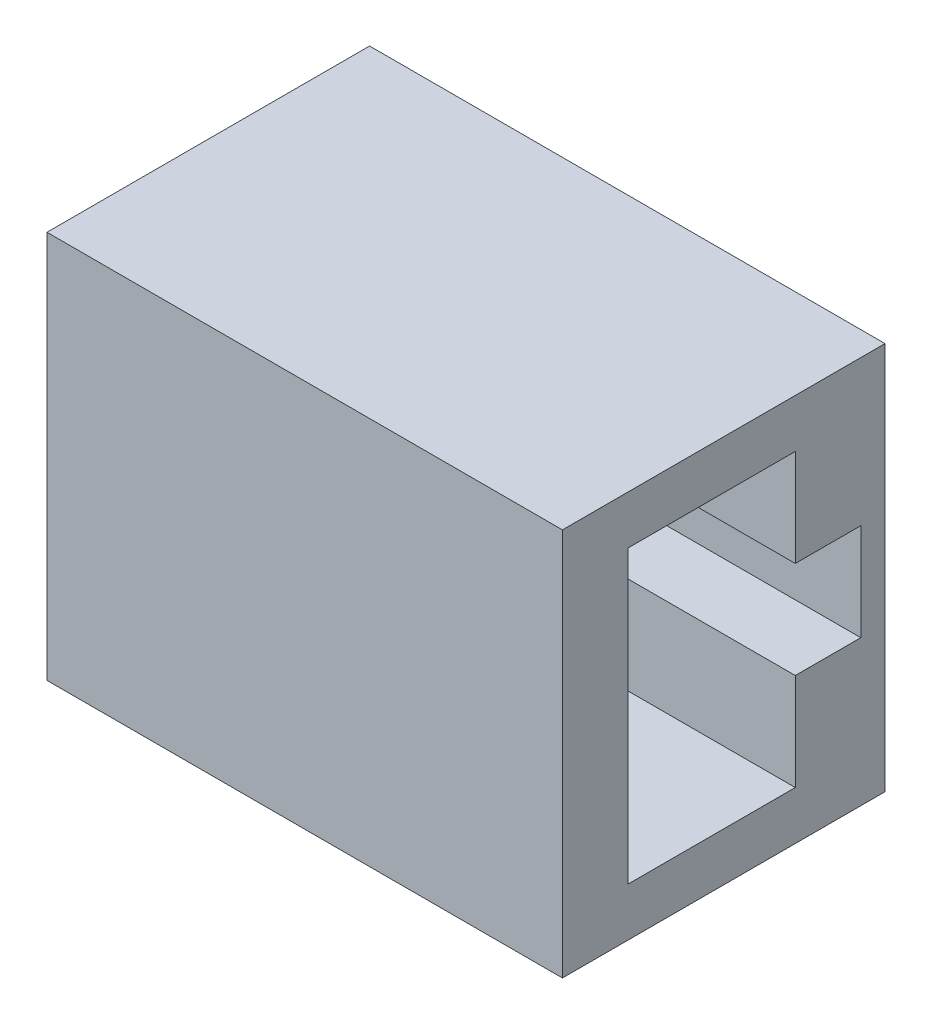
ISO-10303-21;
HEADER;
FILE_DESCRIPTION(('STEP AP214'),'2;1');
FILE_NAME('part.step','',(''),(''),'','','');
FILE_SCHEMA(('AUTOMOTIVE_DESIGN { 1 0 10303 214 1 1 1 1 }'));
ENDSEC;
DATA;
#1=APPLICATION_CONTEXT('core data for automotive mechanical design processes');
#2=APPLICATION_PROTOCOL_DEFINITION('international standard','automotive_design',2000,#1);
#3=PRODUCT_CONTEXT('',#1,'mechanical');
#4=PRODUCT('Part','Part','',(#3));
#5=PRODUCT_RELATED_PRODUCT_CATEGORY('part','',(#4));
#6=PRODUCT_DEFINITION_FORMATION('','',#4);
#7=PRODUCT_DEFINITION_CONTEXT('part definition',#1,'design');
#8=PRODUCT_DEFINITION('design','',#6,#7);
#9=PRODUCT_DEFINITION_SHAPE('','',#8);
#10=(LENGTH_UNIT() NAMED_UNIT(*) SI_UNIT(.MILLI.,.METRE.));
#11=(NAMED_UNIT(*) PLANE_ANGLE_UNIT() SI_UNIT($,.RADIAN.));
#12=(NAMED_UNIT(*) SI_UNIT($,.STERADIAN.) SOLID_ANGLE_UNIT());
#13=UNCERTAINTY_MEASURE_WITH_UNIT(LENGTH_MEASURE(1.E-05),#10,'distance_accuracy_value','');
#14=(GEOMETRIC_REPRESENTATION_CONTEXT(3) GLOBAL_UNCERTAINTY_ASSIGNED_CONTEXT((#13)) GLOBAL_UNIT_ASSIGNED_CONTEXT((#10,
#11,#12)) REPRESENTATION_CONTEXT('',''));
#15=CARTESIAN_POINT('',(0.,0.,0.));
#16=DIRECTION('',(0.,0.,1.));
#17=DIRECTION('',(1.,0.,0.));
#18=AXIS2_PLACEMENT_3D('',#15,#16,#17);
#19=CARTESIAN_POINT('',(10.625,8.,13.3));
#20=DIRECTION('',(-1.,0.,0.));
#21=DIRECTION('',(0.,0.,1.));
#22=AXIS2_PLACEMENT_3D('',#19,#20,#21);
#23=PLANE('',#22);
#24=DIRECTION('',(0.,0.,-1.));
#25=VECTOR('',#24,1.);
#26=CARTESIAN_POINT('',(10.625,6.,10.6));
#27=LINE('',#26,#25);
#28=CARTESIAN_POINT('',(10.625,6.,10.6));
#29=VERTEX_POINT('',#28);
#30=CARTESIAN_POINT('',(10.625,6.,3.7));
#31=VERTEX_POINT('',#30);
#32=EDGE_CURVE('E145',#29,#31,#27,.T.);
#33=ORIENTED_EDGE('',*,*,#32,.T.);
#34=DIRECTION('',(0.,-1.,0.));
#35=VECTOR('',#34,1.);
#36=CARTESIAN_POINT('',(10.625,6.,3.7));
#37=LINE('',#36,#35);
#38=CARTESIAN_POINT('',(10.625,2.,3.7));
#39=VERTEX_POINT('',#38);
#40=EDGE_CURVE('E204',#31,#39,#37,.T.);
#41=ORIENTED_EDGE('',*,*,#40,.T.);
#42=DIRECTION('',(0.,0.,-1.));
#43=VECTOR('',#42,1.);
#44=CARTESIAN_POINT('',(10.625,2.,3.7));
#45=LINE('',#44,#43);
#46=CARTESIAN_POINT('',(10.625,2.,1.));
#47=VERTEX_POINT('',#46);
#48=EDGE_CURVE('E205',#39,#47,#45,.T.);
#49=ORIENTED_EDGE('',*,*,#48,.T.);
#50=DIRECTION('',(0.,1.,0.));
#51=VECTOR('',#50,1.);
#52=CARTESIAN_POINT('',(10.625,-2.,1.));
#53=LINE('',#52,#51);
#54=CARTESIAN_POINT('',(10.625,-2.,1.));
#55=VERTEX_POINT('',#54);
#56=EDGE_CURVE('E237',#55,#47,#53,.T.);
#57=ORIENTED_EDGE('',*,*,#56,.F.);
#58=DIRECTION('',(0.,0.,-1.));
#59=VECTOR('',#58,1.);
#60=CARTESIAN_POINT('',(10.625,-2.,3.7));
#61=LINE('',#60,#59);
#62=CARTESIAN_POINT('',(10.625,-2.,3.7));
#63=VERTEX_POINT('',#62);
#64=EDGE_CURVE('E210',#63,#55,#61,.T.);
#65=ORIENTED_EDGE('',*,*,#64,.F.);
#66=DIRECTION('',(0.,-1.,0.));
#67=VECTOR('',#66,1.);
#68=CARTESIAN_POINT('',(10.625,-2.,3.7));
#69=LINE('',#68,#67);
#70=CARTESIAN_POINT('',(10.625,-6.,3.7));
#71=VERTEX_POINT('',#70);
#72=EDGE_CURVE('E176',#63,#71,#69,.T.);
#73=ORIENTED_EDGE('',*,*,#72,.T.);
#74=DIRECTION('',(0.,0.,-1.));
#75=VECTOR('',#74,1.);
#76=CARTESIAN_POINT('',(10.625,-6.,10.6));
#77=LINE('',#76,#75);
#78=CARTESIAN_POINT('',(10.625,-6.,10.6));
#79=VERTEX_POINT('',#78);
#80=EDGE_CURVE('E150',#79,#71,#77,.T.);
#81=ORIENTED_EDGE('',*,*,#80,.F.);
#82=DIRECTION('',(0.,-1.,0.));
#83=VECTOR('',#82,1.);
#84=CARTESIAN_POINT('',(10.625,6.,10.6));
#85=LINE('',#84,#83);
#86=EDGE_CURVE('E181',#29,#79,#85,.T.);
#87=ORIENTED_EDGE('',*,*,#86,.F.);
#88=EDGE_LOOP('',(#33,#41,#49,#57,#65,#73,#81,#87));
#89=FACE_BOUND('',#88,.T.);
#90=DIRECTION('',(0.,1.,0.));
#91=VECTOR('',#90,1.);
#92=CARTESIAN_POINT('',(10.625,8.,0.));
#93=LINE('',#92,#91);
#94=CARTESIAN_POINT('',(10.625,-8.,0.));
#95=VERTEX_POINT('',#94);
#96=CARTESIAN_POINT('',(10.625,8.,0.));
#97=VERTEX_POINT('',#96);
#98=EDGE_CURVE('E192',#95,#97,#93,.T.);
#99=ORIENTED_EDGE('',*,*,#98,.T.);
#100=DIRECTION('',(0.,0.,-1.));
#101=VECTOR('',#100,1.);
#102=CARTESIAN_POINT('',(10.625,8.,13.3));
#103=LINE('',#102,#101);
#104=CARTESIAN_POINT('',(10.625,8.,13.3));
#105=VERTEX_POINT('',#104);
#106=EDGE_CURVE('E39',#105,#97,#103,.T.);
#107=ORIENTED_EDGE('',*,*,#106,.F.);
#108=DIRECTION('',(0.,1.,0.));
#109=VECTOR('',#108,1.);
#110=CARTESIAN_POINT('',(10.625,8.,13.3));
#111=LINE('',#110,#109);
#112=CARTESIAN_POINT('',(10.625,-8.,13.3));
#113=VERTEX_POINT('',#112);
#114=EDGE_CURVE('E265',#113,#105,#111,.T.);
#115=ORIENTED_EDGE('',*,*,#114,.F.);
#116=DIRECTION('',(0.,0.,-1.));
#117=VECTOR('',#116,1.);
#118=CARTESIAN_POINT('',(10.625,-8.,13.3));
#119=LINE('',#118,#117);
#120=EDGE_CURVE('E26',#113,#95,#119,.T.);
#121=ORIENTED_EDGE('',*,*,#120,.T.);
#122=EDGE_LOOP('',(#99,#107,#115,#121));
#123=FACE_BOUND('',#122,.T.);
#124=ADVANCED_FACE('F17',(#89,#123),#23,.F.);
#125=CARTESIAN_POINT('',(-10.625,8.,13.3));
#126=DIRECTION('',(1.,0.,0.));
#127=DIRECTION('',(0.,1.,0.));
#128=AXIS2_PLACEMENT_3D('',#125,#126,#127);
#129=PLANE('',#128);
#130=DIRECTION('',(0.,-1.,0.));
#131=VECTOR('',#130,1.);
#132=CARTESIAN_POINT('',(-10.625,8.,0.));
#133=LINE('',#132,#131);
#134=CARTESIAN_POINT('',(-10.625,8.,0.));
#135=VERTEX_POINT('',#134);
#136=CARTESIAN_POINT('',(-10.625,-8.,0.));
#137=VERTEX_POINT('',#136);
#138=EDGE_CURVE('E254',#135,#137,#133,.T.);
#139=ORIENTED_EDGE('',*,*,#138,.T.);
#140=DIRECTION('',(0.,0.,-1.));
#141=VECTOR('',#140,1.);
#142=CARTESIAN_POINT('',(-10.625,-8.,13.3));
#143=LINE('',#142,#141);
#144=CARTESIAN_POINT('',(-10.625,-8.,13.3));
#145=VERTEX_POINT('',#144);
#146=EDGE_CURVE('E11',#145,#137,#143,.T.);
#147=ORIENTED_EDGE('',*,*,#146,.F.);
#148=DIRECTION('',(0.,-1.,0.));
#149=VECTOR('',#148,1.);
#150=CARTESIAN_POINT('',(-10.625,8.,13.3));
#151=LINE('',#150,#149);
#152=CARTESIAN_POINT('',(-10.625,8.,13.3));
#153=VERTEX_POINT('',#152);
#154=EDGE_CURVE('E191',#153,#145,#151,.T.);
#155=ORIENTED_EDGE('',*,*,#154,.F.);
#156=DIRECTION('',(0.,0.,-1.));
#157=VECTOR('',#156,1.);
#158=CARTESIAN_POINT('',(-10.625,8.,13.3));
#159=LINE('',#158,#157);
#160=EDGE_CURVE('E228',#153,#135,#159,.T.);
#161=ORIENTED_EDGE('',*,*,#160,.T.);
#162=EDGE_LOOP('',(#139,#147,#155,#161));
#163=FACE_BOUND('',#162,.T.);
#164=ADVANCED_FACE('F19',(#163),#129,.F.);
#165=CARTESIAN_POINT('',(-10.625,-8.,13.3));
#166=DIRECTION('',(0.,1.,0.));
#167=DIRECTION('',(1.,0.,0.));
#168=AXIS2_PLACEMENT_3D('',#165,#166,#167);
#169=PLANE('',#168);
#170=DIRECTION('',(1.,0.,0.));
#171=VECTOR('',#170,1.);
#172=CARTESIAN_POINT('',(-10.625,-8.,0.));
#173=LINE('',#172,#171);
#174=EDGE_CURVE('E188',#137,#95,#173,.T.);
#175=ORIENTED_EDGE('',*,*,#174,.T.);
#176=ORIENTED_EDGE('',*,*,#120,.F.);
#177=DIRECTION('',(1.,0.,0.));
#178=VECTOR('',#177,1.);
#179=CARTESIAN_POINT('',(-10.625,-8.,13.3));
#180=LINE('',#179,#178);
#181=EDGE_CURVE('E269',#145,#113,#180,.T.);
#182=ORIENTED_EDGE('',*,*,#181,.F.);
#183=ORIENTED_EDGE('',*,*,#146,.T.);
#184=EDGE_LOOP('',(#175,#176,#182,#183));
#185=FACE_BOUND('',#184,.T.);
#186=ADVANCED_FACE('F283',(#185),#169,.F.);
#187=CARTESIAN_POINT('',(-10.625,8.,13.3));
#188=DIRECTION('',(0.,-1.,0.));
#189=DIRECTION('',(0.,0.,-1.));
#190=AXIS2_PLACEMENT_3D('',#187,#188,#189);
#191=PLANE('',#190);
#192=DIRECTION('',(-1.,0.,0.));
#193=VECTOR('',#192,1.);
#194=CARTESIAN_POINT('',(-10.625,8.,0.));
#195=LINE('',#194,#193);
#196=EDGE_CURVE('E218',#97,#135,#195,.T.);
#197=ORIENTED_EDGE('',*,*,#196,.T.);
#198=ORIENTED_EDGE('',*,*,#160,.F.);
#199=DIRECTION('',(-1.,0.,0.));
#200=VECTOR('',#199,1.);
#201=CARTESIAN_POINT('',(-10.625,8.,13.3));
#202=LINE('',#201,#200);
#203=EDGE_CURVE('E261',#105,#153,#202,.T.);
#204=ORIENTED_EDGE('',*,*,#203,.F.);
#205=ORIENTED_EDGE('',*,*,#106,.T.);
#206=EDGE_LOOP('',(#197,#198,#204,#205));
#207=FACE_BOUND('',#206,.T.);
#208=ADVANCED_FACE('F288',(#207),#191,.F.);
#209=CARTESIAN_POINT('',(0.,0.,13.3));
#210=DIRECTION('',(0.,0.,1.));
#211=DIRECTION('',(1.,0.,0.));
#212=AXIS2_PLACEMENT_3D('',#209,#210,#211);
#213=PLANE('',#212);
#214=ORIENTED_EDGE('',*,*,#154,.T.);
#215=ORIENTED_EDGE('',*,*,#181,.T.);
#216=ORIENTED_EDGE('',*,*,#114,.T.);
#217=ORIENTED_EDGE('',*,*,#203,.T.);
#218=EDGE_LOOP('',(#214,#215,#216,#217));
#219=FACE_BOUND('',#218,.T.);
#220=ADVANCED_FACE('F291',(#219),#213,.T.);
#221=CARTESIAN_POINT('',(0.,0.,0.));
#222=DIRECTION('',(0.,0.,1.));
#223=DIRECTION('',(1.,0.,0.));
#224=AXIS2_PLACEMENT_3D('',#221,#222,#223);
#225=PLANE('',#224);
#226=ORIENTED_EDGE('',*,*,#138,.F.);
#227=ORIENTED_EDGE('',*,*,#196,.F.);
#228=ORIENTED_EDGE('',*,*,#98,.F.);
#229=ORIENTED_EDGE('',*,*,#174,.F.);
#230=EDGE_LOOP('',(#226,#227,#228,#229));
#231=FACE_BOUND('',#230,.T.);
#232=ADVANCED_FACE('F286',(#231),#225,.F.);
#233=CARTESIAN_POINT('',(0.825,6.,10.6));
#234=DIRECTION('',(0.,-1.,0.));
#235=DIRECTION('',(-1.,0.,0.));
#236=AXIS2_PLACEMENT_3D('',#233,#234,#235);
#237=PLANE('',#236);
#238=ORIENTED_EDGE('',*,*,#32,.F.);
#239=DIRECTION('',(1.,0.,0.));
#240=VECTOR('',#239,1.);
#241=CARTESIAN_POINT('',(0.825,6.,10.6));
#242=LINE('',#241,#240);
#243=CARTESIAN_POINT('',(0.825,6.,10.6));
#244=VERTEX_POINT('',#243);
#245=EDGE_CURVE('E139',#244,#29,#242,.T.);
#246=ORIENTED_EDGE('',*,*,#245,.F.);
#247=DIRECTION('',(0.,0.,-1.));
#248=VECTOR('',#247,1.);
#249=CARTESIAN_POINT('',(0.825,6.,10.6));
#250=LINE('',#249,#248);
#251=CARTESIAN_POINT('',(0.825,6.,3.7));
#252=VERTEX_POINT('',#251);
#253=EDGE_CURVE('E144',#244,#252,#250,.T.);
#254=ORIENTED_EDGE('',*,*,#253,.T.);
#255=DIRECTION('',(1.,0.,0.));
#256=VECTOR('',#255,1.);
#257=CARTESIAN_POINT('',(0.825,6.,3.7));
#258=LINE('',#257,#256);
#259=EDGE_CURVE('E249',#252,#31,#258,.T.);
#260=ORIENTED_EDGE('',*,*,#259,.T.);
#261=EDGE_LOOP('',(#238,#246,#254,#260));
#262=FACE_BOUND('',#261,.T.);
#263=ADVANCED_FACE('F141',(#262),#237,.T.);
#264=CARTESIAN_POINT('',(0.825,6.,3.7));
#265=DIRECTION('',(0.,0.,1.));
#266=DIRECTION('',(0.,-1.,0.));
#267=AXIS2_PLACEMENT_3D('',#264,#265,#266);
#268=PLANE('',#267);
#269=ORIENTED_EDGE('',*,*,#40,.F.);
#270=ORIENTED_EDGE('',*,*,#259,.F.);
#271=DIRECTION('',(0.,-1.,0.));
#272=VECTOR('',#271,1.);
#273=CARTESIAN_POINT('',(0.825,6.,3.7));
#274=LINE('',#273,#272);
#275=CARTESIAN_POINT('',(0.825,2.,3.7));
#276=VERTEX_POINT('',#275);
#277=EDGE_CURVE('E167',#252,#276,#274,.T.);
#278=ORIENTED_EDGE('',*,*,#277,.T.);
#279=DIRECTION('',(1.,0.,0.));
#280=VECTOR('',#279,1.);
#281=CARTESIAN_POINT('',(0.825,2.,3.7));
#282=LINE('',#281,#280);
#283=EDGE_CURVE('E200',#276,#39,#282,.T.);
#284=ORIENTED_EDGE('',*,*,#283,.T.);
#285=EDGE_LOOP('',(#269,#270,#278,#284));
#286=FACE_BOUND('',#285,.T.);
#287=ADVANCED_FACE('F307',(#286),#268,.T.);
#288=CARTESIAN_POINT('',(0.825,2.,3.7));
#289=DIRECTION('',(0.,-1.,0.));
#290=DIRECTION('',(-1.,0.,0.));
#291=AXIS2_PLACEMENT_3D('',#288,#289,#290);
#292=PLANE('',#291);
#293=ORIENTED_EDGE('',*,*,#48,.F.);
#294=ORIENTED_EDGE('',*,*,#283,.F.);
#295=DIRECTION('',(0.,0.,-1.));
#296=VECTOR('',#295,1.);
#297=CARTESIAN_POINT('',(0.825,2.,3.7));
#298=LINE('',#297,#296);
#299=CARTESIAN_POINT('',(0.825,2.,1.));
#300=VERTEX_POINT('',#299);
#301=EDGE_CURVE('E209',#276,#300,#298,.T.);
#302=ORIENTED_EDGE('',*,*,#301,.T.);
#303=DIRECTION('',(1.,0.,0.));
#304=VECTOR('',#303,1.);
#305=CARTESIAN_POINT('',(0.825,2.,1.));
#306=LINE('',#305,#304);
#307=EDGE_CURVE('E241',#300,#47,#306,.T.);
#308=ORIENTED_EDGE('',*,*,#307,.T.);
#309=EDGE_LOOP('',(#293,#294,#302,#308));
#310=FACE_BOUND('',#309,.T.);
#311=ADVANCED_FACE('F310',(#310),#292,.T.);
#312=CARTESIAN_POINT('',(0.825,-2.,1.));
#313=DIRECTION('',(0.,0.,-1.));
#314=DIRECTION('',(0.,-1.,0.));
#315=AXIS2_PLACEMENT_3D('',#312,#313,#314);
#316=PLANE('',#315);
#317=ORIENTED_EDGE('',*,*,#56,.T.);
#318=ORIENTED_EDGE('',*,*,#307,.F.);
#319=DIRECTION('',(0.,1.,0.));
#320=VECTOR('',#319,1.);
#321=CARTESIAN_POINT('',(0.825,-2.,1.));
#322=LINE('',#321,#320);
#323=CARTESIAN_POINT('',(0.825,-2.,1.));
#324=VERTEX_POINT('',#323);
#325=EDGE_CURVE('E196',#324,#300,#322,.T.);
#326=ORIENTED_EDGE('',*,*,#325,.F.);
#327=DIRECTION('',(1.,0.,0.));
#328=VECTOR('',#327,1.);
#329=CARTESIAN_POINT('',(0.825,-2.,1.));
#330=LINE('',#329,#328);
#331=EDGE_CURVE('E214',#324,#55,#330,.T.);
#332=ORIENTED_EDGE('',*,*,#331,.T.);
#333=EDGE_LOOP('',(#317,#318,#326,#332));
#334=FACE_BOUND('',#333,.T.);
#335=ADVANCED_FACE('F312',(#334),#316,.F.);
#336=CARTESIAN_POINT('',(0.825,-2.,3.7));
#337=DIRECTION('',(0.,-1.,0.));
#338=DIRECTION('',(-1.,0.,0.));
#339=AXIS2_PLACEMENT_3D('',#336,#337,#338);
#340=PLANE('',#339);
#341=ORIENTED_EDGE('',*,*,#64,.T.);
#342=ORIENTED_EDGE('',*,*,#331,.F.);
#343=DIRECTION('',(0.,0.,-1.));
#344=VECTOR('',#343,1.);
#345=CARTESIAN_POINT('',(0.825,-2.,3.7));
#346=LINE('',#345,#344);
#347=CARTESIAN_POINT('',(0.825,-2.,3.7));
#348=VERTEX_POINT('',#347);
#349=EDGE_CURVE('E187',#348,#324,#346,.T.);
#350=ORIENTED_EDGE('',*,*,#349,.F.);
#351=DIRECTION('',(1.,0.,0.));
#352=VECTOR('',#351,1.);
#353=CARTESIAN_POINT('',(0.825,-2.,3.7));
#354=LINE('',#353,#352);
#355=EDGE_CURVE('E215',#348,#63,#354,.T.);
#356=ORIENTED_EDGE('',*,*,#355,.T.);
#357=EDGE_LOOP('',(#341,#342,#350,#356));
#358=FACE_BOUND('',#357,.T.);
#359=ADVANCED_FACE('F315',(#358),#340,.F.);
#360=CARTESIAN_POINT('',(0.825,-2.,3.7));
#361=DIRECTION('',(0.,0.,1.));
#362=DIRECTION('',(0.,-1.,0.));
#363=AXIS2_PLACEMENT_3D('',#360,#361,#362);
#364=PLANE('',#363);
#365=ORIENTED_EDGE('',*,*,#72,.F.);
#366=ORIENTED_EDGE('',*,*,#355,.F.);
#367=DIRECTION('',(0.,-1.,0.));
#368=VECTOR('',#367,1.);
#369=CARTESIAN_POINT('',(0.825,-2.,3.7));
#370=LINE('',#369,#368);
#371=CARTESIAN_POINT('',(0.825,-6.,3.7));
#372=VERTEX_POINT('',#371);
#373=EDGE_CURVE('E180',#348,#372,#370,.T.);
#374=ORIENTED_EDGE('',*,*,#373,.T.);
#375=DIRECTION('',(1.,0.,0.));
#376=VECTOR('',#375,1.);
#377=CARTESIAN_POINT('',(0.825,-6.,3.7));
#378=LINE('',#377,#376);
#379=EDGE_CURVE('E174',#372,#71,#378,.T.);
#380=ORIENTED_EDGE('',*,*,#379,.T.);
#381=EDGE_LOOP('',(#365,#366,#374,#380));
#382=FACE_BOUND('',#381,.T.);
#383=ADVANCED_FACE('F317',(#382),#364,.T.);
#384=CARTESIAN_POINT('',(0.825,-6.,10.6));
#385=DIRECTION('',(0.,-1.,0.));
#386=DIRECTION('',(-1.,0.,0.));
#387=AXIS2_PLACEMENT_3D('',#384,#385,#386);
#388=PLANE('',#387);
#389=ORIENTED_EDGE('',*,*,#80,.T.);
#390=ORIENTED_EDGE('',*,*,#379,.F.);
#391=DIRECTION('',(0.,0.,-1.));
#392=VECTOR('',#391,1.);
#393=CARTESIAN_POINT('',(0.825,-6.,10.6));
#394=LINE('',#393,#392);
#395=CARTESIAN_POINT('',(0.825,-6.,10.6));
#396=VERTEX_POINT('',#395);
#397=EDGE_CURVE('E161',#396,#372,#394,.T.);
#398=ORIENTED_EDGE('',*,*,#397,.F.);
#399=DIRECTION('',(1.,0.,0.));
#400=VECTOR('',#399,1.);
#401=CARTESIAN_POINT('',(0.825,-6.,10.6));
#402=LINE('',#401,#400);
#403=EDGE_CURVE('E151',#396,#79,#402,.T.);
#404=ORIENTED_EDGE('',*,*,#403,.T.);
#405=EDGE_LOOP('',(#389,#390,#398,#404));
#406=FACE_BOUND('',#405,.T.);
#407=ADVANCED_FACE('F305',(#406),#388,.F.);
#408=CARTESIAN_POINT('',(0.825,6.,10.6));
#409=DIRECTION('',(0.,0.,1.));
#410=DIRECTION('',(1.,0.,0.));
#411=AXIS2_PLACEMENT_3D('',#408,#409,#410);
#412=PLANE('',#411);
#413=ORIENTED_EDGE('',*,*,#86,.T.);
#414=ORIENTED_EDGE('',*,*,#403,.F.);
#415=DIRECTION('',(0.,-1.,0.));
#416=VECTOR('',#415,1.);
#417=CARTESIAN_POINT('',(0.825,6.,10.6));
#418=LINE('',#417,#416);
#419=EDGE_CURVE('E154',#244,#396,#418,.T.);
#420=ORIENTED_EDGE('',*,*,#419,.F.);
#421=ORIENTED_EDGE('',*,*,#245,.T.);
#422=EDGE_LOOP('',(#413,#414,#420,#421));
#423=FACE_BOUND('',#422,.T.);
#424=ADVANCED_FACE('F155',(#423),#412,.F.);
#425=CARTESIAN_POINT('',(0.825,0.,0.));
#426=DIRECTION('',(-1.,0.,0.));
#427=DIRECTION('',(0.,0.,1.));
#428=AXIS2_PLACEMENT_3D('',#425,#426,#427);
#429=PLANE('',#428);
#430=ORIENTED_EDGE('',*,*,#253,.F.);
#431=ORIENTED_EDGE('',*,*,#419,.T.);
#432=ORIENTED_EDGE('',*,*,#397,.T.);
#433=ORIENTED_EDGE('',*,*,#373,.F.);
#434=ORIENTED_EDGE('',*,*,#349,.T.);
#435=ORIENTED_EDGE('',*,*,#325,.T.);
#436=ORIENTED_EDGE('',*,*,#301,.F.);
#437=ORIENTED_EDGE('',*,*,#277,.F.);
#438=EDGE_LOOP('',(#430,#431,#432,#433,#434,#435,#436,#437));
#439=FACE_BOUND('',#438,.T.);
#440=ADVANCED_FACE('F164',(#439),#429,.F.);
#441=CLOSED_SHELL('',(#124,#164,#186,#208,#220,#232,#263,#287,#311,#335,#359,#383,#407,#424,#440));
#442=MANIFOLD_SOLID_BREP('B1',#441);
#443=ADVANCED_BREP_SHAPE_REPRESENTATION('',(#18,#442),#14);
#444=SHAPE_DEFINITION_REPRESENTATION(#9,#443);
ENDSEC;
END-ISO-10303-21;
